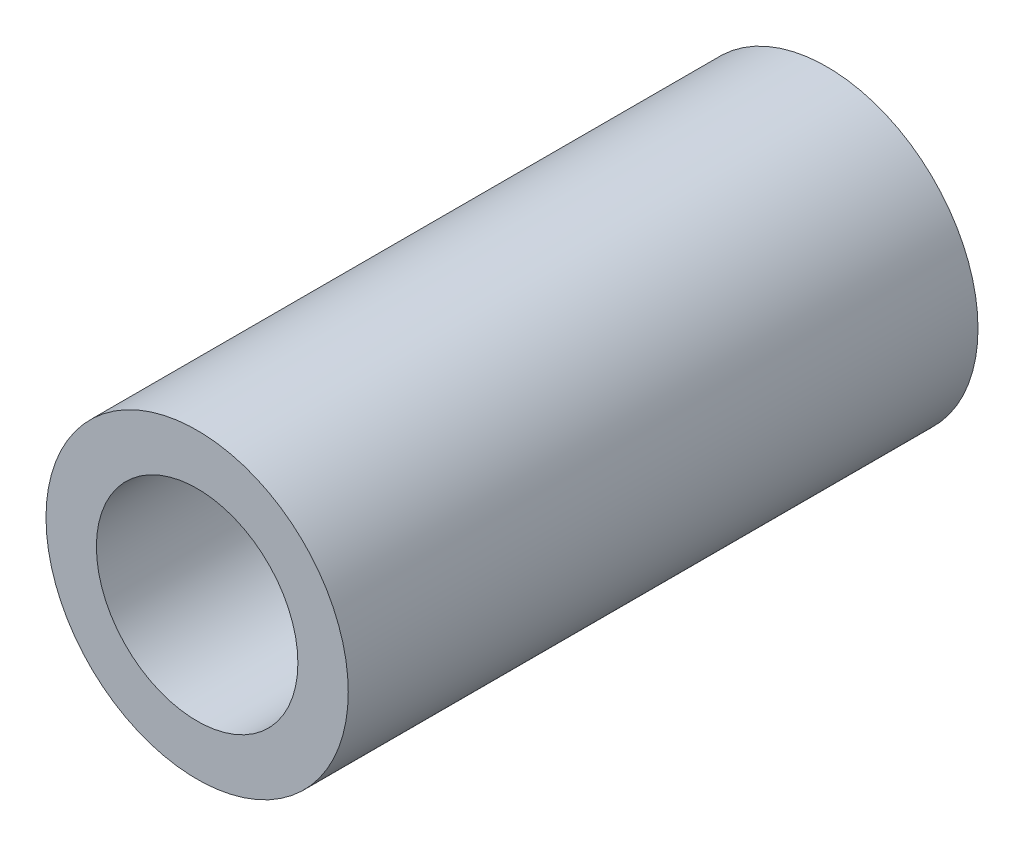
from build123d import *

# Parameters (mm, degrees)
ESQUISSE1_R      = 3
ESQUISSE1_R_2    = 2
EXTRUSION1_DEPTH = 12.5


with BuildPart() as part:
    # Esquisse1 → Extrusion1 (new body)
    with BuildSketch(Plane.XY):
        Circle(ESQUISSE1_R)
        Circle(ESQUISSE1_R_2, mode=Mode.SUBTRACT)
    extrude(amount=EXTRUSION1_DEPTH)


solid = part.part
